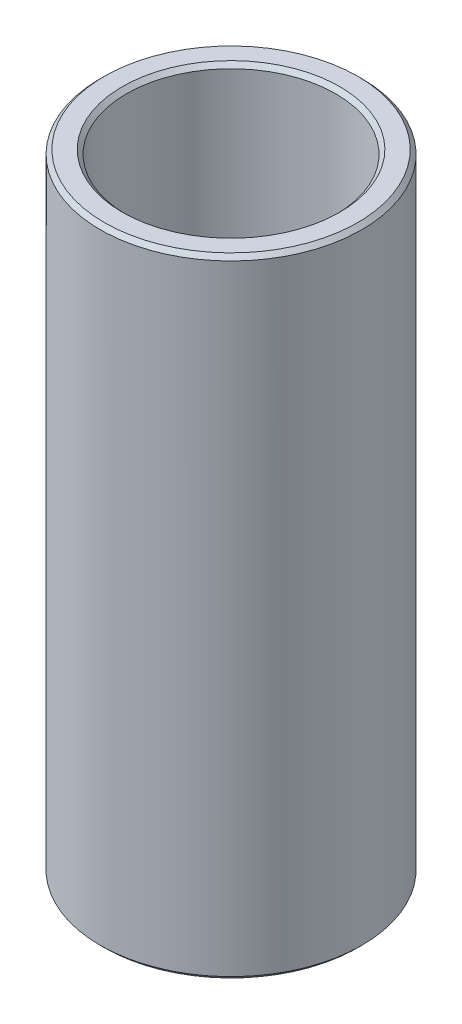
from build123d import *

# Parameters (mm, degrees)
SKETCH1_R      = 7.9375
SKETCH1_R_2    = 6.35
EXTRUDE1_DEPTH = 38.1
CHAMFER1_SIZE  = 0.25


with BuildPart() as part:
    # Sketch1 → Extrude1 (new body)
    with BuildSketch(Plane(origin=(0, 0, 0), x_dir=(1, 0, 0), z_dir=(0, 1, 0))):
        with Locations(Location((0, 0, 0), (0, 0, 90))):
            Circle(SKETCH1_R)
        with Locations(Location((0, 0, 0), (0, 0, 90))):
            Circle(SKETCH1_R_2, mode=Mode.SUBTRACT)
    extrude(amount=EXTRUDE1_DEPTH)

    # Chamfer1
    chamfer1_edges = [part.edges().sort_by_distance(p)[0] for p in [
        (0, 0, 7.9375),
        (0, 38.1, 7.9375),
        (0, 0, 6.35),
        (0, 38.1, 6.35),
    ]]
    chamfer(chamfer1_edges, length=CHAMFER1_SIZE)


solid = part.part
